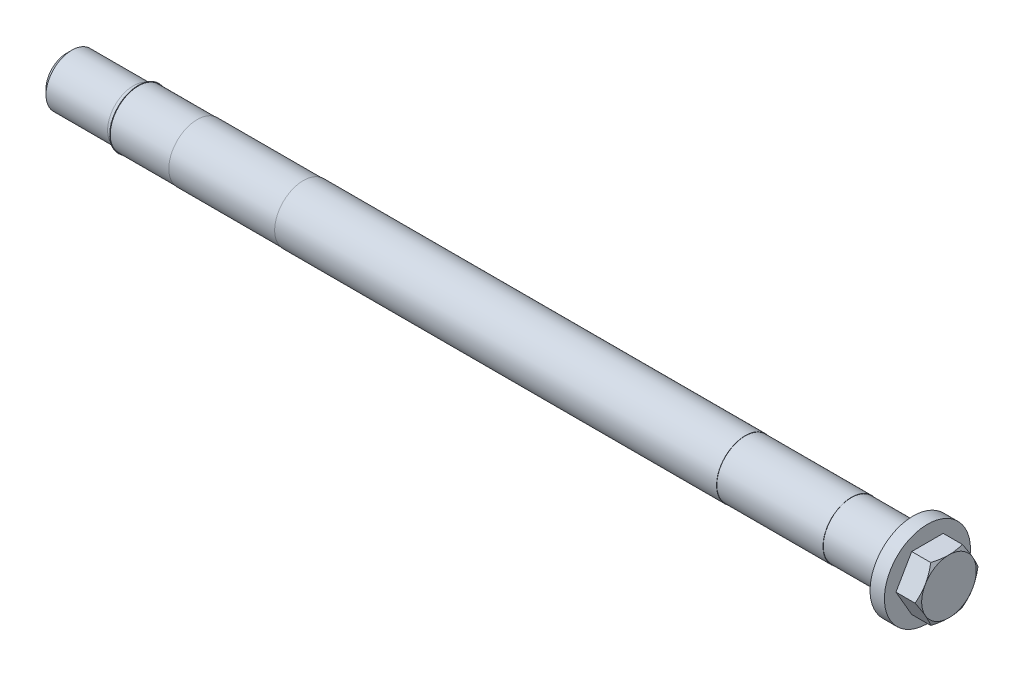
ISO-10303-21;
HEADER;
FILE_DESCRIPTION(('STEP AP214'),'2;1');
FILE_NAME('part.step','',(''),(''),'','','');
FILE_SCHEMA(('AUTOMOTIVE_DESIGN { 1 0 10303 214 1 1 1 1 }'));
ENDSEC;
DATA;
#1=APPLICATION_CONTEXT('core data for automotive mechanical design processes');
#2=APPLICATION_PROTOCOL_DEFINITION('international standard','automotive_design',2000,#1);
#3=PRODUCT_CONTEXT('',#1,'mechanical');
#4=PRODUCT('Part','Part','',(#3));
#5=PRODUCT_RELATED_PRODUCT_CATEGORY('part','',(#4));
#6=PRODUCT_DEFINITION_FORMATION('','',#4);
#7=PRODUCT_DEFINITION_CONTEXT('part definition',#1,'design');
#8=PRODUCT_DEFINITION('design','',#6,#7);
#9=PRODUCT_DEFINITION_SHAPE('','',#8);
#10=(LENGTH_UNIT() NAMED_UNIT(*) SI_UNIT(.MILLI.,.METRE.));
#11=(NAMED_UNIT(*) PLANE_ANGLE_UNIT() SI_UNIT($,.RADIAN.));
#12=(NAMED_UNIT(*) SI_UNIT($,.STERADIAN.) SOLID_ANGLE_UNIT());
#13=UNCERTAINTY_MEASURE_WITH_UNIT(LENGTH_MEASURE(1.E-05),#10,'distance_accuracy_value','');
#14=(GEOMETRIC_REPRESENTATION_CONTEXT(3) GLOBAL_UNCERTAINTY_ASSIGNED_CONTEXT((#13)) GLOBAL_UNIT_ASSIGNED_CONTEXT((#10,
#11,#12)) REPRESENTATION_CONTEXT('',''));
#15=CARTESIAN_POINT('',(0.,0.,0.));
#16=DIRECTION('',(0.,0.,1.));
#17=DIRECTION('',(1.,0.,0.));
#18=AXIS2_PLACEMENT_3D('',#15,#16,#17);
#19=CARTESIAN_POINT('',(7.5,-9.5,-5.48482755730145));
#20=DIRECTION('',(0.,0.5,0.866025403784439));
#21=DIRECTION('',(0.,-0.866025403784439,0.5));
#22=AXIS2_PLACEMENT_3D('',#19,#20,#21);
#23=PLANE('',#22);
#24=DIRECTION('',(-1.,0.,0.));
#25=VECTOR('',#24,1.);
#26=CARTESIAN_POINT('',(7.5,0.,-10.9696551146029));
#27=LINE('',#26,#25);
#28=CARTESIAN_POINT('',(6.65149422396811,0.,-10.9696551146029));
#29=VERTEX_POINT('',#28);
#30=CARTESIAN_POINT('',(0.,0.,-10.9696551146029));
#31=VERTEX_POINT('',#30);
#32=EDGE_CURVE('E141',#29,#31,#27,.T.);
#33=ORIENTED_EDGE('',*,*,#32,.F.);
#34=CARTESIAN_POINT('',(6.65142755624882,0.000199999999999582,-10.9697705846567));
#35=CARTESIAN_POINT('',(6.72102656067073,-0.208630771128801,-10.8492020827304));
#36=CARTESIAN_POINT('',(6.78746669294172,-0.41824017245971,-10.7281840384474));
#37=CARTESIAN_POINT('',(6.91315271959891,-0.839139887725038,-10.4851774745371));
#38=CARTESIAN_POINT('',(6.97239624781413,-1.05043073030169,-10.3631886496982));
#39=CARTESIAN_POINT('',(7.13818542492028,-1.68770779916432,-9.99525656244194));
#40=CARTESIAN_POINT('',(7.23248555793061,-2.11620976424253,-9.74786083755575));
#41=CARTESIAN_POINT('',(7.34306129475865,-2.75744333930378,-9.37764446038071));
#42=CARTESIAN_POINT('',(7.37456017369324,-2.96825921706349,-9.25592985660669));
#43=CARTESIAN_POINT('',(7.42738179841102,-3.39086703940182,-9.01193711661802));
#44=CARTESIAN_POINT('',(7.44870434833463,-3.60265900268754,-8.88965896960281));
#45=CARTESIAN_POINT('',(7.48062697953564,-4.0265962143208,-8.64489870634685));
#46=CARTESIAN_POINT('',(7.49123980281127,-4.23874074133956,-8.52241700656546));
#47=CARTESIAN_POINT('',(7.50151746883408,-4.66322575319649,-8.2773404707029));
#48=CARTESIAN_POINT('',(7.50118264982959,-4.87556623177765,-8.15474563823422));
#49=CARTESIAN_POINT('',(7.49032663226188,-5.27254199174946,-7.92555157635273));
#50=CARTESIAN_POINT('',(7.48112973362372,-5.45720529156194,-7.81893617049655));
#51=CARTESIAN_POINT('',(7.45463460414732,-5.82610000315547,-7.6059547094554));
#52=CARTESIAN_POINT('',(7.43733580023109,-6.01033138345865,-7.49958867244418));
#53=CARTESIAN_POINT('',(7.37369551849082,-6.56231167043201,-7.18090270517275));
#54=CARTESIAN_POINT('',(7.31561809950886,-6.92908353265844,-6.96914687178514));
#55=CARTESIAN_POINT('',(7.17042398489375,-7.66651782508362,-6.5433889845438));
#56=CARTESIAN_POINT('',(7.08269183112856,-8.03708614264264,-6.32944126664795));
#57=CARTESIAN_POINT('',(6.88357626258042,-8.77269671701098,-5.90473630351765));
#58=CARTESIAN_POINT('',(6.77223961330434,-9.137748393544,-5.69397361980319));
#59=CARTESIAN_POINT('',(6.65142755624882,-9.5002,-5.48471208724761));
#60=B_SPLINE_CURVE_WITH_KNOTS('',3,(#34,#35,#36,#37,#38,#39,#40,#41,#42,#43,#44,#45,#46,#47,#48,
#49,#50,#51,#52,#53,#54,#55,#56,#57,#58,#59),.UNSPECIFIED.,.F.,.F.,(4,2,2,2,2,2,2,2,2,2,2,2,4),
(0.,0.752880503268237,1.50600787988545,3.0154687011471,3.75167336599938,4.48789219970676,
5.22323407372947,5.95855322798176,6.59868084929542,7.23885375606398,8.52010929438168,
9.82978009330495,11.1368800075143),.UNSPECIFIED.);
#61=CARTESIAN_POINT('',(7.5,-4.75,-8.22724133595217));
#62=VERTEX_POINT('',#61);
#63=EDGE_CURVE('E190',#29,#62,#60,.T.);
#64=ORIENTED_EDGE('',*,*,#63,.T.);
#65=CARTESIAN_POINT('',(6.65149422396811,-9.5,-5.48482755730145));
#66=VERTEX_POINT('',#65);
#67=EDGE_CURVE('E247',#62,#66,#60,.T.);
#68=ORIENTED_EDGE('',*,*,#67,.T.);
#69=DIRECTION('',(-1.,0.,0.));
#70=VECTOR('',#69,1.);
#71=CARTESIAN_POINT('',(7.5,-9.5,-5.48482755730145));
#72=LINE('',#71,#70);
#73=CARTESIAN_POINT('',(0.,-9.5,-5.48482755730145));
#74=VERTEX_POINT('',#73);
#75=EDGE_CURVE('E113',#66,#74,#72,.T.);
#76=ORIENTED_EDGE('',*,*,#75,.T.);
#77=DIRECTION('',(0.,0.866025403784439,-0.5));
#78=VECTOR('',#77,1.);
#79=CARTESIAN_POINT('',(0.,-9.5,-5.48482755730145));
#80=LINE('',#79,#78);
#81=EDGE_CURVE('E109',#74,#31,#80,.T.);
#82=ORIENTED_EDGE('',*,*,#81,.T.);
#83=EDGE_LOOP('',(#33,#64,#68,#76,#82));
#84=FACE_BOUND('',#83,.T.);
#85=ADVANCED_FACE('F33',(#84),#23,.F.);
#86=CARTESIAN_POINT('',(7.5,0.,-10.9696551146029));
#87=DIRECTION('',(0.,-0.5,0.866025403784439));
#88=DIRECTION('',(0.,-0.866025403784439,-0.5));
#89=AXIS2_PLACEMENT_3D('',#86,#87,#88);
#90=PLANE('',#89);
#91=DIRECTION('',(-1.,0.,0.));
#92=VECTOR('',#91,1.);
#93=CARTESIAN_POINT('',(7.5,9.5,-5.48482755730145));
#94=LINE('',#93,#92);
#95=CARTESIAN_POINT('',(6.65149422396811,9.5,-5.48482755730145));
#96=VERTEX_POINT('',#95);
#97=CARTESIAN_POINT('',(0.,9.5,-5.48482755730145));
#98=VERTEX_POINT('',#97);
#99=EDGE_CURVE('E138',#96,#98,#94,.T.);
#100=ORIENTED_EDGE('',*,*,#99,.F.);
#101=CARTESIAN_POINT('',(6.65142755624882,9.5002,-5.48471208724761));
#102=CARTESIAN_POINT('',(6.72102656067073,9.2913692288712,-5.6052805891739));
#103=CARTESIAN_POINT('',(6.78746669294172,9.08175982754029,-5.72629863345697));
#104=CARTESIAN_POINT('',(6.91315271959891,8.66086011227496,-5.96930519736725));
#105=CARTESIAN_POINT('',(6.97239624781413,8.44956926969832,-6.09129402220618));
#106=CARTESIAN_POINT('',(7.13818542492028,7.81229220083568,-6.45922610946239));
#107=CARTESIAN_POINT('',(7.23248555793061,7.38379023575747,-6.70662183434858));
#108=CARTESIAN_POINT('',(7.34306129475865,6.74255666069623,-7.07683821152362));
#109=CARTESIAN_POINT('',(7.37456017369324,6.53174078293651,-7.19855281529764));
#110=CARTESIAN_POINT('',(7.42738179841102,6.10913296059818,-7.44254555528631));
#111=CARTESIAN_POINT('',(7.44870434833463,5.89734099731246,-7.56482370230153));
#112=CARTESIAN_POINT('',(7.48062697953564,5.47340378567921,-7.80958396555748));
#113=CARTESIAN_POINT('',(7.49123980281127,5.26125925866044,-7.93206566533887));
#114=CARTESIAN_POINT('',(7.50151746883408,4.83677424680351,-8.17714220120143));
#115=CARTESIAN_POINT('',(7.50118264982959,4.62443376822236,-8.29973703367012));
#116=CARTESIAN_POINT('',(7.49032663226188,4.22745800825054,-8.5289310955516));
#117=CARTESIAN_POINT('',(7.48112973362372,4.04279470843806,-8.63554650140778));
#118=CARTESIAN_POINT('',(7.45463460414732,3.67389999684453,-8.84852796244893));
#119=CARTESIAN_POINT('',(7.43733580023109,3.48966861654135,-8.95489399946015));
#120=CARTESIAN_POINT('',(7.37369551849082,2.93768832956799,-9.27357996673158));
#121=CARTESIAN_POINT('',(7.31561809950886,2.57091646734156,-9.4853358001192));
#122=CARTESIAN_POINT('',(7.17042398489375,1.83348217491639,-9.91109368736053));
#123=CARTESIAN_POINT('',(7.08269183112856,1.46291385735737,-10.1250414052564));
#124=CARTESIAN_POINT('',(6.88357626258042,0.727303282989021,-10.5497463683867));
#125=CARTESIAN_POINT('',(6.77223961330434,0.362251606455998,-10.7605090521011));
#126=CARTESIAN_POINT('',(6.65142755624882,-0.000200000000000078,-10.9697705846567));
#127=B_SPLINE_CURVE_WITH_KNOTS('',3,(#101,#102,#103,#104,#105,#106,#107,#108,#109,#110,#111,
#112,#113,#114,#115,#116,#117,#118,#119,#120,#121,#122,#123,#124,#125,#126),.UNSPECIFIED.,.F.,
.F.,(4,2,2,2,2,2,2,2,2,2,2,2,4),(0.,0.752880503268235,1.50600787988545,3.0154687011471,
3.75167336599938,4.48789219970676,5.22323407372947,5.95855322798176,6.59868084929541,
7.23885375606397,8.52010929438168,9.82978009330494,11.1368800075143),.UNSPECIFIED.);
#128=CARTESIAN_POINT('',(7.5,4.75,-8.22724133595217));
#129=VERTEX_POINT('',#128);
#130=EDGE_CURVE('E197',#96,#129,#127,.T.);
#131=ORIENTED_EDGE('',*,*,#130,.T.);
#132=EDGE_CURVE('E196',#129,#29,#127,.T.);
#133=ORIENTED_EDGE('',*,*,#132,.T.);
#134=ORIENTED_EDGE('',*,*,#32,.T.);
#135=DIRECTION('',(0.,0.866025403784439,0.5));
#136=VECTOR('',#135,1.);
#137=CARTESIAN_POINT('',(0.,0.,-10.9696551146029));
#138=LINE('',#137,#136);
#139=EDGE_CURVE('E194',#31,#98,#138,.T.);
#140=ORIENTED_EDGE('',*,*,#139,.T.);
#141=EDGE_LOOP('',(#100,#131,#133,#134,#140));
#142=FACE_BOUND('',#141,.T.);
#143=ADVANCED_FACE('F180',(#142),#90,.F.);
#144=CARTESIAN_POINT('',(7.5,9.5,-5.48482755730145));
#145=DIRECTION('',(0.,-1.,0.));
#146=DIRECTION('',(0.,0.,-1.));
#147=AXIS2_PLACEMENT_3D('',#144,#145,#146);
#148=PLANE('',#147);
#149=DIRECTION('',(-1.,0.,0.));
#150=VECTOR('',#149,1.);
#151=CARTESIAN_POINT('',(7.5,9.49999999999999,5.48482755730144));
#152=LINE('',#151,#150);
#153=CARTESIAN_POINT('',(6.65149422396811,9.49999999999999,5.48482755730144));
#154=VERTEX_POINT('',#153);
#155=CARTESIAN_POINT('',(0.,9.49999999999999,5.48482755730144));
#156=VERTEX_POINT('',#155);
#157=EDGE_CURVE('E135',#154,#156,#152,.T.);
#158=ORIENTED_EDGE('',*,*,#157,.F.);
#159=CARTESIAN_POINT('',(2.75678463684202,9.50000000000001,-14.9528788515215));
#160=CARTESIAN_POINT('',(2.85835414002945,9.50000000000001,-14.7444486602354));
#161=CARTESIAN_POINT('',(2.95943348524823,9.50000000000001,-14.535779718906));
#162=CARTESIAN_POINT('',(3.16050124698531,9.50000000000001,-14.1179145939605));
#163=CARTESIAN_POINT('',(3.26048965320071,9.50000000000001,-13.9087184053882));
#164=CARTESIAN_POINT('',(3.55867753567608,9.50000000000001,-13.2802115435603));
#165=CARTESIAN_POINT('',(3.75507114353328,9.50000000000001,-12.8600409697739));
#166=CARTESIAN_POINT('',(4.14290637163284,9.50000000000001,-12.0147775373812));
#167=CARTESIAN_POINT('',(4.33431706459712,9.5,-11.5896704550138));
#168=CARTESIAN_POINT('',(4.70959512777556,9.5,-10.7361513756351));
#169=CARTESIAN_POINT('',(4.89346284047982,9.5,-10.3077395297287));
#170=CARTESIAN_POINT('',(5.25771635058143,9.5,-9.43238833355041));
#171=CARTESIAN_POINT('',(5.43777469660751,9.5,-8.98531199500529));
#172=CARTESIAN_POINT('',(5.78478911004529,9.5,-8.0860120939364));
#173=CARTESIAN_POINT('',(5.95174373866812,9.5,-7.63378797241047));
#174=CARTESIAN_POINT('',(6.26832836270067,9.5,-6.72424461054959));
#175=CARTESIAN_POINT('',(6.41799158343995,9.5,-6.2669370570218));
#176=CARTESIAN_POINT('',(6.69533897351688,9.5,-5.3457819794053));
#177=CARTESIAN_POINT('',(6.82302983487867,9.5,-4.88193649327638));
#178=CARTESIAN_POINT('',(7.04976839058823,9.5,-3.94992913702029));
#179=CARTESIAN_POINT('',(7.1489760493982,9.5,-3.48180724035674));
#180=CARTESIAN_POINT('',(7.27223352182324,9.5,-2.77519154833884));
#181=CARTESIAN_POINT('',(7.30906189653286,9.5,-2.53889877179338));
#182=CARTESIAN_POINT('',(7.373484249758,9.5,-2.06506545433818));
#183=CARTESIAN_POINT('',(7.40107912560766,9.5,-1.82752503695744));
#184=CARTESIAN_POINT('',(7.44612664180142,9.5,-1.35471450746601));
#185=CARTESIAN_POINT('',(7.4637111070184,9.5,-1.11945700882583));
#186=CARTESIAN_POINT('',(7.48890647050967,9.5,-0.648408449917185));
#187=CARTESIAN_POINT('',(7.4965175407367,9.5,-0.412617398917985));
#188=CARTESIAN_POINT('',(7.50158358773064,9.5,0.0590772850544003));
#189=CARTESIAN_POINT('',(7.49903850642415,9.5,0.294980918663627));
#190=CARTESIAN_POINT('',(7.48385685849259,9.5,0.766465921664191));
#191=CARTESIAN_POINT('',(7.47121982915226,9.5,1.00204727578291));
#192=CARTESIAN_POINT('',(7.42949213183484,9.5,1.56159315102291));
#193=CARTESIAN_POINT('',(7.39598225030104,9.49999999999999,1.88523567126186));
#194=CARTESIAN_POINT('',(7.31169429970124,9.49999999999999,2.53024659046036));
#195=CARTESIAN_POINT('',(7.26091407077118,9.49999999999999,2.85161469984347));
#196=CARTESIAN_POINT('',(7.08535016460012,9.49999999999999,3.81185894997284));
#197=CARTESIAN_POINT('',(6.93737020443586,9.49999999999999,4.44655737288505));
#198=CARTESIAN_POINT('',(6.6790789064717,9.49999999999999,5.39610378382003));
#199=CARTESIAN_POINT('',(6.58564770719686,9.49999999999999,5.71582773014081));
#200=CARTESIAN_POINT('',(6.38866638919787,9.49999999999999,6.35217394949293));
#201=CARTESIAN_POINT('',(6.28511619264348,9.49999999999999,6.66879619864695));
#202=CARTESIAN_POINT('',(6.06959262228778,9.49999999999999,7.29903427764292));
#203=CARTESIAN_POINT('',(5.95762162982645,9.49999999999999,7.61265092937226));
#204=CARTESIAN_POINT('',(5.72661534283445,9.49999999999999,8.23725488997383));
#205=CARTESIAN_POINT('',(5.60758020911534,9.49999999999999,8.54824225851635));
#206=CARTESIAN_POINT('',(5.27849403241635,9.49999999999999,9.38409106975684));
#207=CARTESIAN_POINT('',(5.06289353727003,9.49999999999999,9.90676552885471));
#208=CARTESIAN_POINT('',(4.61905005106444,9.49999999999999,10.9467387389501));
#209=CARTESIAN_POINT('',(4.39080566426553,9.49999999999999,11.4640368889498));
#210=CARTESIAN_POINT('',(3.92466239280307,9.49999999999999,12.4944889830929));
#211=CARTESIAN_POINT('',(3.68675984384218,9.49999999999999,13.007641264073));
#212=CARTESIAN_POINT('',(3.20360703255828,9.49999999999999,14.0304377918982));
#213=CARTESIAN_POINT('',(2.95835706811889,9.49999999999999,14.5400821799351));
#214=CARTESIAN_POINT('',(2.46170931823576,9.49999999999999,15.5573727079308));
#215=CARTESIAN_POINT('',(2.21030230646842,9.49999999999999,16.0650143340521));
#216=CARTESIAN_POINT('',(1.70291136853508,9.49999999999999,17.0780064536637));
#217=CARTESIAN_POINT('',(1.446927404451,9.49999999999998,17.5833569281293));
#218=CARTESIAN_POINT('',(0.931337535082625,9.49999999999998,18.5920638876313));
#219=CARTESIAN_POINT('',(0.671732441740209,9.49999999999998,19.0954207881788));
#220=CARTESIAN_POINT('',(0.149521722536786,9.49999999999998,20.1005765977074));
#221=CARTESIAN_POINT('',(-0.113083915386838,9.49999999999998,20.6023755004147));
#222=CARTESIAN_POINT('',(-0.848855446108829,9.49999999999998,21.9999619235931));
#223=CARTESIAN_POINT('',(-1.32472651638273,9.49999999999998,22.8943249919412));
#224=CARTESIAN_POINT('',(-2.28219050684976,9.49999999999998,24.6800468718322));
#225=CARTESIAN_POINT('',(-2.76378377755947,9.49999999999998,25.5714054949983));
#226=CARTESIAN_POINT('',(-3.72961779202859,9.49999999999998,27.3488188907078));
#227=CARTESIAN_POINT('',(-4.2138442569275,9.49999999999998,28.2348814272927));
#228=CARTESIAN_POINT('',(-4.94260546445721,9.49999999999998,29.5625994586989));
#229=CARTESIAN_POINT('',(-5.18591992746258,9.49999999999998,30.0049256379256));
#230=CARTESIAN_POINT('',(-5.67327208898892,9.49999999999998,30.8891786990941));
#231=CARTESIAN_POINT('',(-5.9173097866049,9.49999999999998,31.3311055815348));
#232=CARTESIAN_POINT('',(-6.16166434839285,9.49999999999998,31.7728572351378));
#233=B_SPLINE_CURVE_WITH_KNOTS('',3,(#159,#160,#161,#162,#163,#164,#165,#166,#167,#168,#169,
#170,#171,#172,#173,#174,#175,#176,#177,#178,#179,#180,#181,#182,#183,#184,#185,#186,#187,#188,
#189,#190,#191,#192,#193,#194,#195,#196,#197,#198,#199,#200,#201,#202,#203,#204,#205,#206,#207,
#208,#209,#210,#211,#212,#213,#214,#215,#216,#217,#218,#219,#220,#221,#222,#223,#224,#225,#226,
#227,#228,#229,#230,#231,#232),.UNSPECIFIED.,.F.,.F.,(4,2,2,2,2,2,2,2,2,2,2,2,2,2,2,2,2,2,2,2,2,
2,2,2,2,2,2,2,2,2,2,2,2,2,2,2,4),(0.,0.695581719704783,1.39117000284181,2.78254153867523,
4.18112162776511,5.57963814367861,7.02539856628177,8.4713175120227,9.91441022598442,
11.3570626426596,12.7914469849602,13.5087318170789,14.2259469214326,14.9334846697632,
15.6410102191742,16.3485398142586,17.0561018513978,18.031673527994,19.0073672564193,
20.9597067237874,21.9589043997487,22.9581097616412,23.9570336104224,24.955934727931,
26.651872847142,28.3479985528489,30.0447738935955,31.741480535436,33.4409074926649,
35.1403485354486,36.83941446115,38.538487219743,41.577705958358,44.6171118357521,
47.646333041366,49.1608256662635,50.6753163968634),.UNSPECIFIED.);
#234=CARTESIAN_POINT('',(7.5,9.5,0.));
#235=VERTEX_POINT('',#234);
#236=EDGE_CURVE('E262',#154,#235,#233,.F.);
#237=ORIENTED_EDGE('',*,*,#236,.T.);
#238=EDGE_CURVE('E216',#235,#96,#233,.F.);
#239=ORIENTED_EDGE('',*,*,#238,.T.);
#240=ORIENTED_EDGE('',*,*,#99,.T.);
#241=DIRECTION('',(0.,0.,1.));
#242=VECTOR('',#241,1.);
#243=CARTESIAN_POINT('',(0.,9.5,-5.48482755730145));
#244=LINE('',#243,#242);
#245=EDGE_CURVE('E129',#98,#156,#244,.T.);
#246=ORIENTED_EDGE('',*,*,#245,.T.);
#247=EDGE_LOOP('',(#158,#237,#239,#240,#246));
#248=FACE_BOUND('',#247,.T.);
#249=ADVANCED_FACE('F185',(#248),#148,.F.);
#250=CARTESIAN_POINT('',(7.5,9.49999999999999,5.48482755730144));
#251=DIRECTION('',(0.,-0.5,-0.866025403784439));
#252=DIRECTION('',(0.,0.866025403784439,-0.5));
#253=AXIS2_PLACEMENT_3D('',#250,#251,#252);
#254=PLANE('',#253);
#255=DIRECTION('',(-1.,0.,0.));
#256=VECTOR('',#255,1.);
#257=CARTESIAN_POINT('',(7.5,0.,10.9696551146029));
#258=LINE('',#257,#256);
#259=CARTESIAN_POINT('',(6.65149422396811,0.,10.9696551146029));
#260=VERTEX_POINT('',#259);
#261=CARTESIAN_POINT('',(0.,0.,10.9696551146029));
#262=VERTEX_POINT('',#261);
#263=EDGE_CURVE('E121',#260,#262,#258,.T.);
#264=ORIENTED_EDGE('',*,*,#263,.F.);
#265=CARTESIAN_POINT('',(6.65142755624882,-0.000200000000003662,10.9697705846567));
#266=CARTESIAN_POINT('',(6.72102656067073,0.208630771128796,10.8492020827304));
#267=CARTESIAN_POINT('',(6.78746669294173,0.418240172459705,10.7281840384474));
#268=CARTESIAN_POINT('',(6.91315271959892,0.839139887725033,10.4851774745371));
#269=CARTESIAN_POINT('',(6.97239624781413,1.05043073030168,10.3631886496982));
#270=CARTESIAN_POINT('',(7.13818542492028,1.68770779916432,9.99525656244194));
#271=CARTESIAN_POINT('',(7.23248555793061,2.11620976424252,9.74786083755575));
#272=CARTESIAN_POINT('',(7.34306129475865,2.75744333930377,9.37764446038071));
#273=CARTESIAN_POINT('',(7.37456017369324,2.96825921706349,9.25592985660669));
#274=CARTESIAN_POINT('',(7.42738179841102,3.39086703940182,9.01193711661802));
#275=CARTESIAN_POINT('',(7.44870434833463,3.60265900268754,8.8896589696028));
#276=CARTESIAN_POINT('',(7.48062697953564,4.02659621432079,8.64489870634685));
#277=CARTESIAN_POINT('',(7.49123980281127,4.23874074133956,8.52241700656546));
#278=CARTESIAN_POINT('',(7.50151746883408,4.66322575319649,8.2773404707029));
#279=CARTESIAN_POINT('',(7.50118264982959,4.87556623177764,8.15474563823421));
#280=CARTESIAN_POINT('',(7.49032663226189,5.27254199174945,7.92555157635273));
#281=CARTESIAN_POINT('',(7.48112973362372,5.45720529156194,7.81893617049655));
#282=CARTESIAN_POINT('',(7.45463460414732,5.82610000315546,7.6059547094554));
#283=CARTESIAN_POINT('',(7.43733580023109,6.01033138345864,7.49958867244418));
#284=CARTESIAN_POINT('',(7.37369551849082,6.562311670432,7.18090270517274));
#285=CARTESIAN_POINT('',(7.31561809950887,6.92908353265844,6.96914687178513));
#286=CARTESIAN_POINT('',(7.17042398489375,7.66651782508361,6.5433889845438));
#287=CARTESIAN_POINT('',(7.08269183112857,8.03708614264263,6.32944126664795));
#288=CARTESIAN_POINT('',(6.88357626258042,8.77269671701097,5.90473630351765));
#289=CARTESIAN_POINT('',(6.77223961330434,9.137748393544,5.69397361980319));
#290=CARTESIAN_POINT('',(6.65142755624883,9.50019999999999,5.4847120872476));
#291=B_SPLINE_CURVE_WITH_KNOTS('',3,(#265,#266,#267,#268,#269,#270,#271,#272,#273,#274,#275,
#276,#277,#278,#279,#280,#281,#282,#283,#284,#285,#286,#287,#288,#289,#290),.UNSPECIFIED.,.F.,
.F.,(4,2,2,2,2,2,2,2,2,2,2,2,4),(0.,0.752880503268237,1.50600787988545,3.0154687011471,
3.75167336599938,4.48789219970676,5.22323407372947,5.95855322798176,6.59868084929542,
7.23885375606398,8.52010929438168,9.82978009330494,11.1368800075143),.UNSPECIFIED.);
#292=CARTESIAN_POINT('',(7.5,4.75,8.22724133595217));
#293=VERTEX_POINT('',#292);
#294=EDGE_CURVE('E201',#260,#293,#291,.T.);
#295=ORIENTED_EDGE('',*,*,#294,.T.);
#296=EDGE_CURVE('E203',#293,#154,#291,.T.);
#297=ORIENTED_EDGE('',*,*,#296,.T.);
#298=ORIENTED_EDGE('',*,*,#157,.T.);
#299=DIRECTION('',(0.,-0.866025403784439,0.5));
#300=VECTOR('',#299,1.);
#301=CARTESIAN_POINT('',(0.,9.49999999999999,5.48482755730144));
#302=LINE('',#301,#300);
#303=EDGE_CURVE('E127',#156,#262,#302,.T.);
#304=ORIENTED_EDGE('',*,*,#303,.T.);
#305=EDGE_LOOP('',(#264,#295,#297,#298,#304));
#306=FACE_BOUND('',#305,.T.);
#307=ADVANCED_FACE('F255',(#306),#254,.F.);
#308=CARTESIAN_POINT('',(7.5,0.,10.9696551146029));
#309=DIRECTION('',(0.,0.5,-0.866025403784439));
#310=DIRECTION('',(0.,0.866025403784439,0.5));
#311=AXIS2_PLACEMENT_3D('',#308,#309,#310);
#312=PLANE('',#311);
#313=DIRECTION('',(-1.,0.,0.));
#314=VECTOR('',#313,1.);
#315=CARTESIAN_POINT('',(7.5,-9.5,5.48482755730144));
#316=LINE('',#315,#314);
#317=CARTESIAN_POINT('',(6.65149422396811,-9.5,5.48482755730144));
#318=VERTEX_POINT('',#317);
#319=CARTESIAN_POINT('',(0.,-9.5,5.48482755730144));
#320=VERTEX_POINT('',#319);
#321=EDGE_CURVE('E116',#318,#320,#316,.T.);
#322=ORIENTED_EDGE('',*,*,#321,.F.);
#323=CARTESIAN_POINT('',(6.65142755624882,-9.5002,5.48471208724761));
#324=CARTESIAN_POINT('',(6.72102656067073,-9.2913692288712,5.60528058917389));
#325=CARTESIAN_POINT('',(6.78746669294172,-9.08175982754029,5.72629863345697));
#326=CARTESIAN_POINT('',(6.91315271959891,-8.66086011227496,5.96930519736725));
#327=CARTESIAN_POINT('',(6.97239624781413,-8.44956926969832,6.09129402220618));
#328=CARTESIAN_POINT('',(7.13818542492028,-7.81229220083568,6.4592261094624));
#329=CARTESIAN_POINT('',(7.23248555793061,-7.38379023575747,6.70662183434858));
#330=CARTESIAN_POINT('',(7.34306129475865,-6.74255666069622,7.07683821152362));
#331=CARTESIAN_POINT('',(7.37456017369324,-6.53174078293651,7.19855281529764));
#332=CARTESIAN_POINT('',(7.42738179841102,-6.10913296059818,7.44254555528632));
#333=CARTESIAN_POINT('',(7.44870434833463,-5.89734099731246,7.56482370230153));
#334=CARTESIAN_POINT('',(7.48062697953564,-5.4734037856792,7.80958396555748));
#335=CARTESIAN_POINT('',(7.49123980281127,-5.26125925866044,7.93206566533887));
#336=CARTESIAN_POINT('',(7.50151746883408,-4.83677424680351,8.17714220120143));
#337=CARTESIAN_POINT('',(7.50118264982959,-4.62443376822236,8.29973703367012));
#338=CARTESIAN_POINT('',(7.49032663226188,-4.22745800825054,8.5289310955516));
#339=CARTESIAN_POINT('',(7.48112973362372,-4.04279470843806,8.63554650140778));
#340=CARTESIAN_POINT('',(7.45463460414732,-3.67389999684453,8.84852796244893));
#341=CARTESIAN_POINT('',(7.43733580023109,-3.48966861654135,8.95489399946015));
#342=CARTESIAN_POINT('',(7.37369551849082,-2.93768832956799,9.27357996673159));
#343=CARTESIAN_POINT('',(7.31561809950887,-2.57091646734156,9.4853358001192));
#344=CARTESIAN_POINT('',(7.17042398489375,-1.83348217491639,9.91109368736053));
#345=CARTESIAN_POINT('',(7.08269183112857,-1.46291385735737,10.1250414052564));
#346=CARTESIAN_POINT('',(6.88357626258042,-0.727303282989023,10.5497463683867));
#347=CARTESIAN_POINT('',(6.77223961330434,-0.362251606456,10.7605090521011));
#348=CARTESIAN_POINT('',(6.65142755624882,0.000199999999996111,10.9697705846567));
#349=B_SPLINE_CURVE_WITH_KNOTS('',3,(#323,#324,#325,#326,#327,#328,#329,#330,#331,#332,#333,
#334,#335,#336,#337,#338,#339,#340,#341,#342,#343,#344,#345,#346,#347,#348),.UNSPECIFIED.,.F.,
.F.,(4,2,2,2,2,2,2,2,2,2,2,2,4),(0.,0.752880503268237,1.50600787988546,3.0154687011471,
3.75167336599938,4.48789219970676,5.22323407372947,5.95855322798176,6.59868084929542,
7.23885375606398,8.52010929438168,9.82978009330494,11.1368800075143),.UNSPECIFIED.);
#350=CARTESIAN_POINT('',(7.5,-4.75,8.22724133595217));
#351=VERTEX_POINT('',#350);
#352=EDGE_CURVE('E52',#318,#351,#349,.T.);
#353=ORIENTED_EDGE('',*,*,#352,.T.);
#354=EDGE_CURVE('E205',#351,#260,#349,.T.);
#355=ORIENTED_EDGE('',*,*,#354,.T.);
#356=ORIENTED_EDGE('',*,*,#263,.T.);
#357=DIRECTION('',(0.,-0.866025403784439,-0.5));
#358=VECTOR('',#357,1.);
#359=CARTESIAN_POINT('',(0.,0.,10.9696551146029));
#360=LINE('',#359,#358);
#361=EDGE_CURVE('E106',#262,#320,#360,.T.);
#362=ORIENTED_EDGE('',*,*,#361,.T.);
#363=EDGE_LOOP('',(#322,#353,#355,#356,#362));
#364=FACE_BOUND('',#363,.T.);
#365=ADVANCED_FACE('F123',(#364),#312,.F.);
#366=CARTESIAN_POINT('',(7.5,-9.5,5.48482755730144));
#367=DIRECTION('',(0.,1.,0.));
#368=DIRECTION('',(0.,0.,1.));
#369=AXIS2_PLACEMENT_3D('',#366,#367,#368);
#370=PLANE('',#369);
#371=ORIENTED_EDGE('',*,*,#75,.F.);
#372=CARTESIAN_POINT('',(2.75678464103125,-9.5,-14.952878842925));
#373=CARTESIAN_POINT('',(2.85835414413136,-9.5,-14.7444486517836));
#374=CARTESIAN_POINT('',(2.95943348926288,-9.5,-14.5357797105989));
#375=CARTESIAN_POINT('',(3.16050125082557,-9.5,-14.1179145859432));
#376=CARTESIAN_POINT('',(3.26048965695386,-9.5,-13.9087183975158));
#377=CARTESIAN_POINT('',(3.55867753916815,-9.5,-13.280211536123));
#378=CARTESIAN_POINT('',(3.75507114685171,-9.5,-12.8600409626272));
#379=CARTESIAN_POINT('',(4.1429063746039,-9.5,-12.0147775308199));
#380=CARTESIAN_POINT('',(4.33431706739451,-9.5,-11.5896704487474));
#381=CARTESIAN_POINT('',(4.70959513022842,-9.5,-10.7361513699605));
#382=CARTESIAN_POINT('',(4.89346284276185,-9.5,-10.307739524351));
#383=CARTESIAN_POINT('',(5.25771635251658,-9.5,-9.43238832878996));
#384=CARTESIAN_POINT('',(5.43777469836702,-9.5,-8.98531199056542));
#385=CARTESIAN_POINT('',(5.78478911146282,-9.5,-8.0860120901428));
#386=CARTESIAN_POINT('',(5.9517437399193,-9.5,-7.63378796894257));
#387=CARTESIAN_POINT('',(6.2683283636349,-9.5,-6.7242446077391));
#388=CARTESIAN_POINT('',(6.41799158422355,-9.5,-6.26693705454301));
#389=CARTESIAN_POINT('',(6.69533897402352,-9.5,-5.34578197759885));
#390=CARTESIAN_POINT('',(6.82302983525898,-9.5,-4.88193649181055));
#391=CARTESIAN_POINT('',(7.04976839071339,-9.5,-3.94992913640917));
#392=CARTESIAN_POINT('',(7.14897604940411,-9.5,-3.48180724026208));
#393=CARTESIAN_POINT('',(7.27223352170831,-9.5,-2.77519154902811));
#394=CARTESIAN_POINT('',(7.30906189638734,-9.5,-2.53889877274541));
#395=CARTESIAN_POINT('',(7.37348424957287,-9.5,-2.065065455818));
#396=CARTESIAN_POINT('',(7.40107912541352,-9.5,-1.8275250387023));
#397=CARTESIAN_POINT('',(7.44612664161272,-9.5,-1.35471450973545));
#398=CARTESIAN_POINT('',(7.46371110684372,-9.5,-1.11945701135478));
#399=CARTESIAN_POINT('',(7.48890647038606,-9.5,-0.648408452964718));
#400=CARTESIAN_POINT('',(7.49651754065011,-9.5,-0.412617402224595));
#401=CARTESIAN_POINT('',(7.50158358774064,-9.5,0.0590772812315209));
#402=CARTESIAN_POINT('',(7.49903850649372,-9.5,0.294980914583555));
#403=CARTESIAN_POINT('',(7.48385685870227,-9.5,0.766465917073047));
#404=CARTESIAN_POINT('',(7.47121982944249,-9.5,1.00204727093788));
#405=CARTESIAN_POINT('',(7.42949213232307,-9.5,1.56159314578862));
#406=CARTESIAN_POINT('',(7.39598225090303,-9.5,1.88523566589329));
#407=CARTESIAN_POINT('',(7.31169430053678,-9.5,2.53024658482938));
#408=CARTESIAN_POINT('',(7.26091407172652,-9.5,2.85161469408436));
#409=CARTESIAN_POINT('',(7.08535016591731,-9.5,3.81185894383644));
#410=CARTESIAN_POINT('',(6.9373702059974,-9.5,4.44655736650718));
#411=CARTESIAN_POINT('',(6.67907890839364,-9.5,5.39610377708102));
#412=CARTESIAN_POINT('',(6.58564770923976,-9.5,5.71582772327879));
#413=CARTESIAN_POINT('',(6.38866639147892,-9.5,6.3521739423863));
#414=CARTESIAN_POINT('',(6.2851161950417,-9.5,6.66879619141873));
#415=CARTESIAN_POINT('',(6.0695926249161,-9.5,7.29903427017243));
#416=CARTESIAN_POINT('',(5.95762163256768,-9.5,7.61265092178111));
#417=CARTESIAN_POINT('',(5.72661534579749,-9.5,8.23725488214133));
#418=CARTESIAN_POINT('',(5.60758021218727,-9.5,8.54824225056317));
#419=CARTESIAN_POINT('',(5.2784940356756,-9.5,9.38409106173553));
#420=CARTESIAN_POINT('',(5.0628935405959,-9.5,9.90676552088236));
#421=CARTESIAN_POINT('',(4.61905005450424,-9.5,10.9467387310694));
#422=CARTESIAN_POINT('',(4.39080566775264,-9.5,11.4640368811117));
#423=CARTESIAN_POINT('',(3.9246623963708,-9.5,12.4944889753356));
#424=CARTESIAN_POINT('',(3.6867598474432,-9.5,13.0076412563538));
#425=CARTESIAN_POINT('',(3.20360703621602,-9.5,14.0304377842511));
#426=CARTESIAN_POINT('',(2.95835707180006,-9.5,14.540082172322));
#427=CARTESIAN_POINT('',(2.46170932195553,-9.5,15.5573727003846));
#428=CARTESIAN_POINT('',(2.21030231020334,-9.5,16.0650143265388));
#429=CARTESIAN_POINT('',(1.70291137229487,-9.5,17.0780064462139));
#430=CARTESIAN_POINT('',(1.44692740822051,-9.5,17.58335692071));
#431=CARTESIAN_POINT('',(0.931337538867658,-9.5,18.5920638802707));
#432=CARTESIAN_POINT('',(0.671732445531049,-9.5,19.0954207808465));
#433=CARTESIAN_POINT('',(0.149521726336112,-9.5,20.10057659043));
#434=CARTESIAN_POINT('',(-0.113083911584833,-9.5,20.6023754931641));
#435=CARTESIAN_POINT('',(-0.848855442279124,-9.5,21.9999619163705));
#436=CARTESIAN_POINT('',(-1.32472651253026,-9.5,22.8943249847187));
#437=CARTESIAN_POINT('',(-2.28219050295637,-9.5,24.680046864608));
#438=CARTESIAN_POINT('',(-2.76378377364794,-9.5,25.5714054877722));
#439=CARTESIAN_POINT('',(-3.72961778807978,-9.5,27.3488188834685));
#440=CARTESIAN_POINT('',(-4.21384425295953,-9.5,28.2348814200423));
#441=CARTESIAN_POINT('',(-4.94260546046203,-9.5,29.5625994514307));
#442=CARTESIAN_POINT('',(-5.18591992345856,-9.5,30.0049256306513));
#443=CARTESIAN_POINT('',(-5.67327208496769,-9.5,30.8891786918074));
#444=CARTESIAN_POINT('',(-5.91730978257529,-9.5,31.3311055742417));
#445=CARTESIAN_POINT('',(-6.16166434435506,-9.5,31.7728572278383));
#446=B_SPLINE_CURVE_WITH_KNOTS('',3,(#372,#373,#374,#375,#376,#377,#378,#379,#380,#381,#382,
#383,#384,#385,#386,#387,#388,#389,#390,#391,#392,#393,#394,#395,#396,#397,#398,#399,#400,#401,
#402,#403,#404,#405,#406,#407,#408,#409,#410,#411,#412,#413,#414,#415,#416,#417,#418,#419,#420,
#421,#422,#423,#424,#425,#426,#427,#428,#429,#430,#431,#432,#433,#434,#435,#436,#437,#438,#439,
#440,#441,#442,#443,#444,#445),.UNSPECIFIED.,.F.,.F.,(4,2,2,2,2,2,2,2,2,2,2,2,2,2,2,2,2,2,2,2,2,
2,2,2,2,2,2,2,2,2,2,2,2,2,2,2,4),(0.,0.695581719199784,1.39117000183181,2.78254153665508,
4.18112162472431,5.57963813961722,7.02539856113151,8.47131750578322,9.91441021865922,
11.3570626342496,12.7914469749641,13.5087318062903,14.2259469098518,14.9334846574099,
15.6410102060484,16.34853980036,17.0561018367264,18.031673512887,19.0073672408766,
20.9597067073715,21.9589043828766,22.9581097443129,23.9570335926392,24.9559347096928,
26.6518728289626,28.347998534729,30.0447738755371,31.7414805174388,33.4409074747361,
35.1403485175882,36.8394144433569,38.5384872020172,41.5777059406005,44.6171118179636,
47.6463330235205,49.1608256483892,50.6753163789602),.UNSPECIFIED.);
#447=CARTESIAN_POINT('',(7.5,-9.5,0.));
#448=VERTEX_POINT('',#447);
#449=EDGE_CURVE('E251',#66,#448,#446,.T.);
#450=ORIENTED_EDGE('',*,*,#449,.T.);
#451=EDGE_CURVE('E119',#448,#318,#446,.T.);
#452=ORIENTED_EDGE('',*,*,#451,.T.);
#453=ORIENTED_EDGE('',*,*,#321,.T.);
#454=DIRECTION('',(0.,0.,-1.));
#455=VECTOR('',#454,1.);
#456=CARTESIAN_POINT('',(0.,-9.5,5.48482755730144));
#457=LINE('',#456,#455);
#458=EDGE_CURVE('E102',#320,#74,#457,.T.);
#459=ORIENTED_EDGE('',*,*,#458,.T.);
#460=EDGE_LOOP('',(#371,#450,#452,#453,#459));
#461=FACE_BOUND('',#460,.T.);
#462=ADVANCED_FACE('F117',(#461),#370,.F.);
#463=CARTESIAN_POINT('',(7.5,0.,0.));
#464=DIRECTION('',(-1.,0.,0.));
#465=DIRECTION('',(0.,0.,1.));
#466=AXIS2_PLACEMENT_3D('',#463,#464,#465);
#467=CONICAL_SURFACE('',#466,9.5,1.0471975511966);
#468=ORIENTED_EDGE('',*,*,#354,.F.);
#469=CARTESIAN_POINT('',(7.5,0.,0.));
#470=DIRECTION('',(-1.,0.,0.));
#471=DIRECTION('',(0.,0.,1.));
#472=AXIS2_PLACEMENT_3D('',#469,#470,#471);
#473=CIRCLE('',#472,9.5);
#474=EDGE_CURVE('E144',#293,#351,#473,.F.);
#475=ORIENTED_EDGE('',*,*,#474,.F.);
#476=ORIENTED_EDGE('',*,*,#294,.F.);
#477=EDGE_LOOP('',(#468,#475,#476));
#478=FACE_BOUND('',#477,.T.);
#479=ADVANCED_FACE('F227',(#478),#467,.T.);
#480=ORIENTED_EDGE('',*,*,#296,.F.);
#481=CARTESIAN_POINT('',(7.5,0.,0.));
#482=DIRECTION('',(-1.,0.,0.));
#483=DIRECTION('',(0.,0.,1.));
#484=AXIS2_PLACEMENT_3D('',#481,#482,#483);
#485=CIRCLE('',#484,9.5);
#486=EDGE_CURVE('E266',#293,#235,#485,.T.);
#487=ORIENTED_EDGE('',*,*,#486,.T.);
#488=ORIENTED_EDGE('',*,*,#236,.F.);
#489=EDGE_LOOP('',(#480,#487,#488));
#490=FACE_BOUND('',#489,.T.);
#491=ADVANCED_FACE('F223',(#490),#467,.T.);
#492=EDGE_CURVE('E147',#129,#235,#473,.F.);
#493=ORIENTED_EDGE('',*,*,#492,.F.);
#494=ORIENTED_EDGE('',*,*,#130,.F.);
#495=ORIENTED_EDGE('',*,*,#238,.F.);
#496=EDGE_LOOP('',(#493,#494,#495));
#497=FACE_BOUND('',#496,.T.);
#498=ADVANCED_FACE('F226',(#497),#467,.T.);
#499=EDGE_CURVE('E588',#62,#129,#473,.F.);
#500=ORIENTED_EDGE('',*,*,#499,.F.);
#501=ORIENTED_EDGE('',*,*,#63,.F.);
#502=ORIENTED_EDGE('',*,*,#132,.F.);
#503=EDGE_LOOP('',(#500,#501,#502));
#504=FACE_BOUND('',#503,.T.);
#505=ADVANCED_FACE('F407',(#504),#467,.T.);
#506=EDGE_CURVE('E587',#448,#62,#473,.F.);
#507=ORIENTED_EDGE('',*,*,#506,.F.);
#508=ORIENTED_EDGE('',*,*,#449,.F.);
#509=ORIENTED_EDGE('',*,*,#67,.F.);
#510=EDGE_LOOP('',(#507,#508,#509));
#511=FACE_BOUND('',#510,.T.);
#512=ADVANCED_FACE('F406',(#511),#467,.T.);
#513=ORIENTED_EDGE('',*,*,#451,.F.);
#514=EDGE_CURVE('E48',#351,#448,#473,.F.);
#515=ORIENTED_EDGE('',*,*,#514,.F.);
#516=ORIENTED_EDGE('',*,*,#352,.F.);
#517=EDGE_LOOP('',(#513,#515,#516));
#518=FACE_BOUND('',#517,.T.);
#519=ADVANCED_FACE('F229',(#518),#467,.T.);
#520=CARTESIAN_POINT('',(7.5,-9.5,-5.48482755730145));
#521=DIRECTION('',(-1.,0.,0.));
#522=DIRECTION('',(0.,0.,1.));
#523=AXIS2_PLACEMENT_3D('',#520,#521,#522);
#524=PLANE('',#523);
#525=ORIENTED_EDGE('',*,*,#474,.T.);
#526=ORIENTED_EDGE('',*,*,#514,.T.);
#527=ORIENTED_EDGE('',*,*,#506,.T.);
#528=ORIENTED_EDGE('',*,*,#499,.T.);
#529=ORIENTED_EDGE('',*,*,#492,.T.);
#530=ORIENTED_EDGE('',*,*,#486,.F.);
#531=EDGE_LOOP('',(#525,#526,#527,#528,#529,#530));
#532=FACE_BOUND('',#531,.T.);
#533=ADVANCED_FACE('F269',(#532),#524,.F.);
#534=CARTESIAN_POINT('',(0.,0.,0.));
#535=DIRECTION('',(1.,0.,0.));
#536=DIRECTION('',(0.,0.,-1.));
#537=AXIS2_PLACEMENT_3D('',#534,#535,#536);
#538=PLANE('',#537);
#539=CARTESIAN_POINT('',(0.,0.,0.));
#540=DIRECTION('',(1.,0.,0.));
#541=DIRECTION('',(0.,0.,-1.));
#542=AXIS2_PLACEMENT_3D('',#539,#540,#541);
#543=CIRCLE('',#542,15.);
#544=CARTESIAN_POINT('',(0.,0.,-15.));
#545=VERTEX_POINT('',#544);
#546=EDGE_CURVE('E271',#545,#545,#543,.T.);
#547=ORIENTED_EDGE('',*,*,#546,.T.);
#548=EDGE_LOOP('',(#547));
#549=FACE_BOUND('',#548,.T.);
#550=ORIENTED_EDGE('',*,*,#81,.F.);
#551=ORIENTED_EDGE('',*,*,#458,.F.);
#552=ORIENTED_EDGE('',*,*,#361,.F.);
#553=ORIENTED_EDGE('',*,*,#303,.F.);
#554=ORIENTED_EDGE('',*,*,#245,.F.);
#555=ORIENTED_EDGE('',*,*,#139,.F.);
#556=EDGE_LOOP('',(#550,#551,#552,#553,#554,#555));
#557=FACE_BOUND('',#556,.T.);
#558=ADVANCED_FACE('F104',(#549,#557),#538,.T.);
#559=CARTESIAN_POINT('',(-5.,0.,0.));
#560=DIRECTION('',(-1.,0.,0.));
#561=DIRECTION('',(0.,0.,1.));
#562=AXIS2_PLACEMENT_3D('',#559,#560,#561);
#563=PLANE('',#562);
#564=CARTESIAN_POINT('',(-5.,0.,0.));
#565=DIRECTION('',(1.,0.,0.));
#566=DIRECTION('',(0.,0.,-1.));
#567=AXIS2_PLACEMENT_3D('',#564,#565,#566);
#568=CIRCLE('',#567,15.);
#569=CARTESIAN_POINT('',(-5.,0.,-15.));
#570=VERTEX_POINT('',#569);
#571=EDGE_CURVE('E273',#570,#570,#568,.T.);
#572=ORIENTED_EDGE('',*,*,#571,.F.);
#573=EDGE_LOOP('',(#572));
#574=FACE_BOUND('',#573,.T.);
#575=CARTESIAN_POINT('',(-5.,0.,0.));
#576=DIRECTION('',(1.,0.,0.));
#577=DIRECTION('',(0.,0.,-1.));
#578=AXIS2_PLACEMENT_3D('',#575,#576,#577);
#579=CIRCLE('',#578,9.8);
#580=CARTESIAN_POINT('',(-5.,0.,-9.8));
#581=VERTEX_POINT('',#580);
#582=EDGE_CURVE('E290',#581,#581,#579,.T.);
#583=ORIENTED_EDGE('',*,*,#582,.T.);
#584=EDGE_LOOP('',(#583));
#585=FACE_BOUND('',#584,.T.);
#586=ADVANCED_FACE('F442',(#574,#585),#563,.T.);
#587=CARTESIAN_POINT('',(0.,0.,0.));
#588=DIRECTION('',(1.,0.,0.));
#589=DIRECTION('',(0.,0.,-1.));
#590=AXIS2_PLACEMENT_3D('',#587,#588,#589);
#591=CYLINDRICAL_SURFACE('',#590,15.);
#592=ORIENTED_EDGE('',*,*,#571,.T.);
#593=EDGE_LOOP('',(#592));
#594=FACE_BOUND('',#593,.T.);
#595=ORIENTED_EDGE('',*,*,#546,.F.);
#596=EDGE_LOOP('',(#595));
#597=FACE_BOUND('',#596,.T.);
#598=ADVANCED_FACE('F344',(#594,#597),#591,.T.);
#599=CARTESIAN_POINT('',(0.,0.,0.));
#600=DIRECTION('',(1.,0.,0.));
#601=DIRECTION('',(0.,0.,-1.));
#602=AXIS2_PLACEMENT_3D('',#599,#600,#601);
#603=CYLINDRICAL_SURFACE('',#602,9.90000000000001);
#604=CARTESIAN_POINT('',(-63.5,0.,0.));
#605=DIRECTION('',(1.,0.,0.));
#606=DIRECTION('',(0.,0.,-1.));
#607=AXIS2_PLACEMENT_3D('',#604,#605,#606);
#608=CIRCLE('',#607,9.90000000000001);
#609=CARTESIAN_POINT('',(-63.5,0.,-9.90000000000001));
#610=VERTEX_POINT('',#609);
#611=EDGE_CURVE('E281',#610,#610,#608,.T.);
#612=ORIENTED_EDGE('',*,*,#611,.T.);
#613=EDGE_LOOP('',(#612));
#614=FACE_BOUND('',#613,.T.);
#615=CARTESIAN_POINT('',(-26.5,0.,0.));
#616=DIRECTION('',(1.,0.,0.));
#617=DIRECTION('',(0.,0.,-1.));
#618=AXIS2_PLACEMENT_3D('',#615,#616,#617);
#619=CIRCLE('',#618,9.9);
#620=CARTESIAN_POINT('',(-26.5,0.,-9.9));
#621=VERTEX_POINT('',#620);
#622=EDGE_CURVE('E278',#621,#621,#619,.T.);
#623=ORIENTED_EDGE('',*,*,#622,.F.);
#624=EDGE_LOOP('',(#623));
#625=FACE_BOUND('',#624,.T.);
#626=ADVANCED_FACE('F349',(#614,#625),#603,.T.);
#627=CARTESIAN_POINT('',(-63.5,0.,10.));
#628=DIRECTION('',(-1.,0.,0.));
#629=DIRECTION('',(0.,0.,1.));
#630=AXIS2_PLACEMENT_3D('',#627,#628,#629);
#631=PLANE('',#630);
#632=ORIENTED_EDGE('',*,*,#611,.F.);
#633=EDGE_LOOP('',(#632));
#634=FACE_BOUND('',#633,.T.);
#635=CARTESIAN_POINT('',(-63.5,0.,0.));
#636=DIRECTION('',(1.,0.,0.));
#637=DIRECTION('',(0.,0.,-1.));
#638=AXIS2_PLACEMENT_3D('',#635,#636,#637);
#639=CIRCLE('',#638,10.);
#640=CARTESIAN_POINT('',(-63.5,0.,-10.));
#641=VERTEX_POINT('',#640);
#642=EDGE_CURVE('E284',#641,#641,#639,.T.);
#643=ORIENTED_EDGE('',*,*,#642,.T.);
#644=EDGE_LOOP('',(#643));
#645=FACE_BOUND('',#644,.T.);
#646=ADVANCED_FACE('F335',(#634,#645),#631,.F.);
#647=CARTESIAN_POINT('',(0.,0.,0.));
#648=DIRECTION('',(1.,0.,0.));
#649=DIRECTION('',(0.,0.,-1.));
#650=AXIS2_PLACEMENT_3D('',#647,#648,#649);
#651=CYLINDRICAL_SURFACE('',#650,9.8);
#652=ORIENTED_EDGE('',*,*,#582,.F.);
#653=EDGE_LOOP('',(#652));
#654=FACE_BOUND('',#653,.T.);
#655=CARTESIAN_POINT('',(-26.5,0.,0.));
#656=DIRECTION('',(1.,0.,0.));
#657=DIRECTION('',(0.,0.,-1.));
#658=AXIS2_PLACEMENT_3D('',#655,#656,#657);
#659=CIRCLE('',#658,9.8);
#660=CARTESIAN_POINT('',(-26.5,0.,-9.8));
#661=VERTEX_POINT('',#660);
#662=EDGE_CURVE('E287',#661,#661,#659,.T.);
#663=ORIENTED_EDGE('',*,*,#662,.T.);
#664=EDGE_LOOP('',(#663));
#665=FACE_BOUND('',#664,.T.);
#666=ADVANCED_FACE('F341',(#654,#665),#651,.T.);
#667=CARTESIAN_POINT('',(-26.5,0.,9.8));
#668=DIRECTION('',(1.,0.,0.));
#669=DIRECTION('',(0.,0.,-1.));
#670=AXIS2_PLACEMENT_3D('',#667,#668,#669);
#671=PLANE('',#670);
#672=ORIENTED_EDGE('',*,*,#662,.F.);
#673=EDGE_LOOP('',(#672));
#674=FACE_BOUND('',#673,.T.);
#675=ORIENTED_EDGE('',*,*,#622,.T.);
#676=EDGE_LOOP('',(#675));
#677=FACE_BOUND('',#676,.T.);
#678=ADVANCED_FACE('F332',(#674,#677),#671,.T.);
#679=CARTESIAN_POINT('',(0.,0.,0.));
#680=DIRECTION('',(1.,0.,0.));
#681=DIRECTION('',(0.,0.,-1.));
#682=AXIS2_PLACEMENT_3D('',#679,#680,#681);
#683=CYLINDRICAL_SURFACE('',#682,9.99999999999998);
#684=CARTESIAN_POINT('',(-217.5,0.,0.));
#685=DIRECTION('',(1.,0.,0.));
#686=DIRECTION('',(0.,0.,-1.));
#687=AXIS2_PLACEMENT_3D('',#684,#685,#686);
#688=CIRCLE('',#687,10.);
#689=CARTESIAN_POINT('',(-217.5,0.,-10.));
#690=VERTEX_POINT('',#689);
#691=EDGE_CURVE('E293',#690,#690,#688,.T.);
#692=ORIENTED_EDGE('',*,*,#691,.T.);
#693=EDGE_LOOP('',(#692));
#694=FACE_BOUND('',#693,.T.);
#695=ORIENTED_EDGE('',*,*,#642,.F.);
#696=EDGE_LOOP('',(#695));
#697=FACE_BOUND('',#696,.T.);
#698=ADVANCED_FACE('F172',(#694,#697),#683,.T.);
#699=CARTESIAN_POINT('',(-254.5,0.,10.));
#700=DIRECTION('',(-1.,0.,0.));
#701=DIRECTION('',(0.,0.,1.));
#702=AXIS2_PLACEMENT_3D('',#699,#700,#701);
#703=PLANE('',#702);
#704=CARTESIAN_POINT('',(-254.5,0.,0.));
#705=DIRECTION('',(1.,0.,0.));
#706=DIRECTION('',(0.,0.,-1.));
#707=AXIS2_PLACEMENT_3D('',#704,#705,#706);
#708=CIRCLE('',#707,9.80000000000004);
#709=CARTESIAN_POINT('',(-254.5,0.,-9.80000000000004));
#710=VERTEX_POINT('',#709);
#711=EDGE_CURVE('E305',#710,#710,#708,.T.);
#712=ORIENTED_EDGE('',*,*,#711,.T.);
#713=EDGE_LOOP('',(#712));
#714=FACE_BOUND('',#713,.T.);
#715=CARTESIAN_POINT('',(-254.5,0.,0.));
#716=DIRECTION('',(-1.,0.,0.));
#717=DIRECTION('',(0.,0.,1.));
#718=AXIS2_PLACEMENT_3D('',#715,#716,#717);
#719=CIRCLE('',#718,9.90000000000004);
#720=CARTESIAN_POINT('',(-254.5,0.,9.90000000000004));
#721=VERTEX_POINT('',#720);
#722=EDGE_CURVE('E308',#721,#721,#719,.T.);
#723=ORIENTED_EDGE('',*,*,#722,.T.);
#724=EDGE_LOOP('',(#723));
#725=FACE_BOUND('',#724,.T.);
#726=ADVANCED_FACE('F312',(#714,#725),#703,.T.);
#727=CARTESIAN_POINT('',(0.,0.,0.));
#728=DIRECTION('',(1.,0.,0.));
#729=DIRECTION('',(0.,0.,-1.));
#730=AXIS2_PLACEMENT_3D('',#727,#728,#729);
#731=CYLINDRICAL_SURFACE('',#730,9.80000000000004);
#732=CARTESIAN_POINT('',(-275.,0.,0.));
#733=DIRECTION('',(1.,0.,0.));
#734=DIRECTION('',(0.,0.,-1.));
#735=AXIS2_PLACEMENT_3D('',#732,#733,#734);
#736=CIRCLE('',#735,9.80000000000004);
#737=CARTESIAN_POINT('',(-275.,0.,-9.80000000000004));
#738=VERTEX_POINT('',#737);
#739=EDGE_CURVE('E302',#738,#738,#736,.T.);
#740=ORIENTED_EDGE('',*,*,#739,.T.);
#741=EDGE_LOOP('',(#740));
#742=FACE_BOUND('',#741,.T.);
#743=ORIENTED_EDGE('',*,*,#711,.F.);
#744=EDGE_LOOP('',(#743));
#745=FACE_BOUND('',#744,.T.);
#746=ADVANCED_FACE('F176',(#742,#745),#731,.T.);
#747=CARTESIAN_POINT('',(-275.,0.,10.));
#748=DIRECTION('',(-1.,0.,0.));
#749=DIRECTION('',(0.,0.,1.));
#750=AXIS2_PLACEMENT_3D('',#747,#748,#749);
#751=PLANE('',#750);
#752=ORIENTED_EDGE('',*,*,#739,.F.);
#753=EDGE_LOOP('',(#752));
#754=FACE_BOUND('',#753,.T.);
#755=CARTESIAN_POINT('',(-275.,0.,0.));
#756=DIRECTION('',(1.,0.,0.));
#757=DIRECTION('',(0.,0.,-1.));
#758=AXIS2_PLACEMENT_3D('',#755,#756,#757);
#759=CIRCLE('',#758,10.);
#760=CARTESIAN_POINT('',(-275.,0.,-10.));
#761=VERTEX_POINT('',#760);
#762=EDGE_CURVE('E299',#761,#761,#759,.T.);
#763=ORIENTED_EDGE('',*,*,#762,.T.);
#764=EDGE_LOOP('',(#763));
#765=FACE_BOUND('',#764,.T.);
#766=ADVANCED_FACE('F165',(#754,#765),#751,.F.);
#767=CARTESIAN_POINT('',(-217.5,0.,9.90000000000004));
#768=DIRECTION('',(1.,0.,0.));
#769=DIRECTION('',(0.,0.,-1.));
#770=AXIS2_PLACEMENT_3D('',#767,#768,#769);
#771=PLANE('',#770);
#772=ORIENTED_EDGE('',*,*,#691,.F.);
#773=EDGE_LOOP('',(#772));
#774=FACE_BOUND('',#773,.T.);
#775=CARTESIAN_POINT('',(-217.5,0.,0.));
#776=DIRECTION('',(1.,0.,0.));
#777=DIRECTION('',(0.,0.,-1.));
#778=AXIS2_PLACEMENT_3D('',#775,#776,#777);
#779=CIRCLE('',#778,9.90000000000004);
#780=CARTESIAN_POINT('',(-217.5,0.,-9.90000000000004));
#781=VERTEX_POINT('',#780);
#782=EDGE_CURVE('E296',#781,#781,#779,.T.);
#783=ORIENTED_EDGE('',*,*,#782,.T.);
#784=EDGE_LOOP('',(#783));
#785=FACE_BOUND('',#784,.T.);
#786=ADVANCED_FACE('F169',(#774,#785),#771,.F.);
#787=CARTESIAN_POINT('',(0.,0.,0.));
#788=DIRECTION('',(1.,0.,0.));
#789=DIRECTION('',(0.,0.,-1.));
#790=AXIS2_PLACEMENT_3D('',#787,#788,#789);
#791=CYLINDRICAL_SURFACE('',#790,9.90000000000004);
#792=ORIENTED_EDGE('',*,*,#722,.F.);
#793=EDGE_LOOP('',(#792));
#794=FACE_BOUND('',#793,.T.);
#795=ORIENTED_EDGE('',*,*,#782,.F.);
#796=EDGE_LOOP('',(#795));
#797=FACE_BOUND('',#796,.T.);
#798=ADVANCED_FACE('F163',(#794,#797),#791,.T.);
#799=CARTESIAN_POINT('',(-300.,0.,0.));
#800=DIRECTION('',(-1.,0.,0.));
#801=DIRECTION('',(0.,0.,1.));
#802=AXIS2_PLACEMENT_3D('',#799,#800,#801);
#803=PLANE('',#802);
#804=CARTESIAN_POINT('',(-300.,0.,0.));
#805=DIRECTION('',(-1.,0.,0.));
#806=DIRECTION('',(0.,0.,1.));
#807=AXIS2_PLACEMENT_3D('',#804,#805,#806);
#808=CIRCLE('',#807,7.19999999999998);
#809=CARTESIAN_POINT('',(-300.,0.,7.19999999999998));
#810=VERTEX_POINT('',#809);
#811=EDGE_CURVE('E148',#810,#810,#808,.T.);
#812=ORIENTED_EDGE('',*,*,#811,.T.);
#813=EDGE_LOOP('',(#812));
#814=FACE_BOUND('',#813,.T.);
#815=ADVANCED_FACE('F158',(#814),#803,.T.);
#816=CARTESIAN_POINT('',(-300.,0.,0.));
#817=DIRECTION('',(1.,0.,0.));
#818=DIRECTION('',(0.,0.,-1.));
#819=AXIS2_PLACEMENT_3D('',#816,#817,#818);
#820=CONICAL_SURFACE('',#819,7.19999999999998,0.785398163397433);
#821=CARTESIAN_POINT('',(-298.2,0.,0.));
#822=DIRECTION('',(-1.,0.,0.));
#823=DIRECTION('',(0.,0.,1.));
#824=AXIS2_PLACEMENT_3D('',#821,#822,#823);
#825=CIRCLE('',#824,9.);
#826=CARTESIAN_POINT('',(-298.2,0.,9.));
#827=VERTEX_POINT('',#826);
#828=EDGE_CURVE('E41',#827,#827,#825,.F.);
#829=ORIENTED_EDGE('',*,*,#828,.F.);
#830=EDGE_LOOP('',(#829));
#831=FACE_BOUND('',#830,.T.);
#832=ORIENTED_EDGE('',*,*,#811,.F.);
#833=EDGE_LOOP('',(#832));
#834=FACE_BOUND('',#833,.T.);
#835=ADVANCED_FACE('F155',(#831,#834),#820,.T.);
#836=CARTESIAN_POINT('',(-300.,0.,0.));
#837=DIRECTION('',(1.,0.,0.));
#838=DIRECTION('',(0.,0.,-1.));
#839=AXIS2_PLACEMENT_3D('',#836,#837,#838);
#840=CYLINDRICAL_SURFACE('',#839,9.);
#841=CARTESIAN_POINT('',(-276.732050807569,0.,0.));
#842=DIRECTION('',(1.,0.,0.));
#843=DIRECTION('',(0.,0.,-1.));
#844=AXIS2_PLACEMENT_3D('',#841,#842,#843);
#845=CIRCLE('',#844,9.);
#846=CARTESIAN_POINT('',(-276.732050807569,0.,-9.));
#847=VERTEX_POINT('',#846);
#848=EDGE_CURVE('E11',#847,#847,#845,.F.);
#849=ORIENTED_EDGE('',*,*,#848,.T.);
#850=EDGE_LOOP('',(#849));
#851=FACE_BOUND('',#850,.T.);
#852=ORIENTED_EDGE('',*,*,#828,.T.);
#853=EDGE_LOOP('',(#852));
#854=FACE_BOUND('',#853,.T.);
#855=ADVANCED_FACE('F153',(#851,#854),#840,.T.);
#856=CARTESIAN_POINT('',(-276.732050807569,0.,0.));
#857=DIRECTION('',(1.,0.,0.));
#858=DIRECTION('',(0.,0.,-1.));
#859=AXIS2_PLACEMENT_3D('',#856,#857,#858);
#860=TOROIDAL_SURFACE('',#859,11.,2.);
#861=ORIENTED_EDGE('',*,*,#762,.F.);
#862=EDGE_LOOP('',(#861));
#863=FACE_BOUND('',#862,.T.);
#864=ORIENTED_EDGE('',*,*,#848,.F.);
#865=EDGE_LOOP('',(#864));
#866=FACE_BOUND('',#865,.T.);
#867=ADVANCED_FACE('F361',(#863,#866),#860,.F.);
#868=CLOSED_SHELL('',(#85,#143,#249,#307,#365,#462,#479,#491,#498,#505,#512,#519,#533,#558,#586,
#598,#626,#646,#666,#678,#698,#726,#746,#766,#786,#798,#815,#835,#855,#867));
#869=MANIFOLD_SOLID_BREP('B2',#868);
#870=ADVANCED_BREP_SHAPE_REPRESENTATION('',(#18,#869),#14);
#871=SHAPE_DEFINITION_REPRESENTATION(#9,#870);
ENDSEC;
END-ISO-10303-21;
